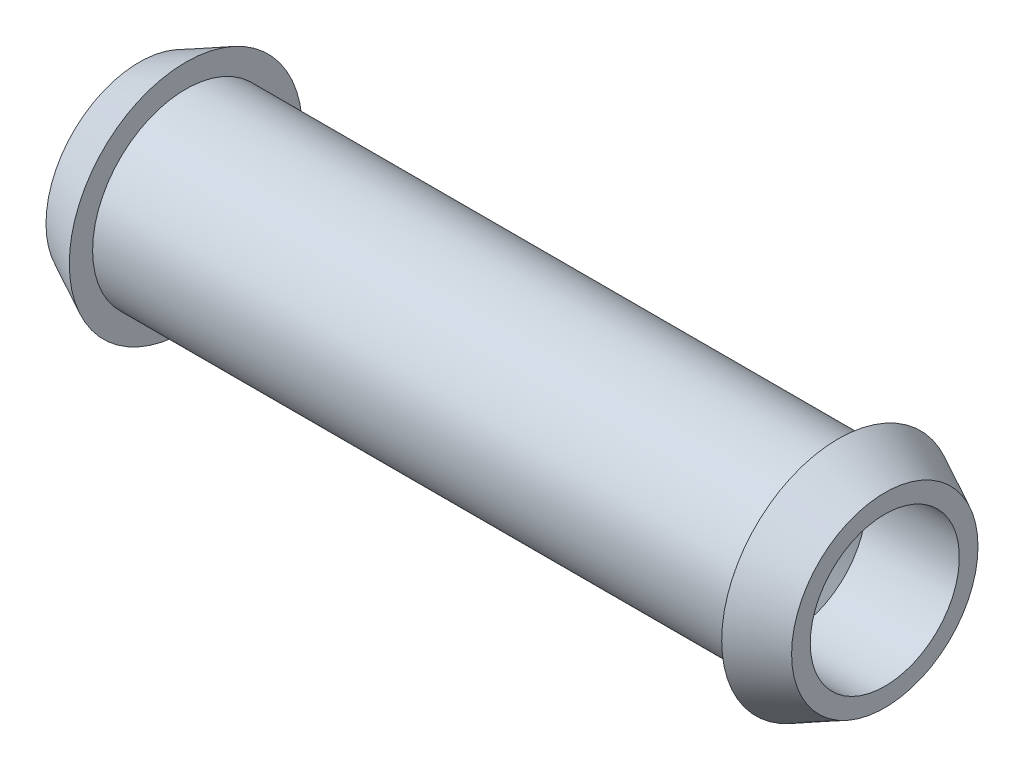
ISO-10303-21;
HEADER;
FILE_DESCRIPTION(('STEP AP214'),'2;1');
FILE_NAME('part.step','',(''),(''),'','','');
FILE_SCHEMA(('AUTOMOTIVE_DESIGN { 1 0 10303 214 1 1 1 1 }'));
ENDSEC;
DATA;
#1=APPLICATION_CONTEXT('core data for automotive mechanical design processes');
#2=APPLICATION_PROTOCOL_DEFINITION('international standard','automotive_design',2000,#1);
#3=PRODUCT_CONTEXT('',#1,'mechanical');
#4=PRODUCT('Part','Part','',(#3));
#5=PRODUCT_RELATED_PRODUCT_CATEGORY('part','',(#4));
#6=PRODUCT_DEFINITION_FORMATION('','',#4);
#7=PRODUCT_DEFINITION_CONTEXT('part definition',#1,'design');
#8=PRODUCT_DEFINITION('design','',#6,#7);
#9=PRODUCT_DEFINITION_SHAPE('','',#8);
#10=(LENGTH_UNIT() NAMED_UNIT(*) SI_UNIT(.MILLI.,.METRE.));
#11=(NAMED_UNIT(*) PLANE_ANGLE_UNIT() SI_UNIT($,.RADIAN.));
#12=(NAMED_UNIT(*) SI_UNIT($,.STERADIAN.) SOLID_ANGLE_UNIT());
#13=UNCERTAINTY_MEASURE_WITH_UNIT(LENGTH_MEASURE(1.E-05),#10,'distance_accuracy_value','');
#14=(GEOMETRIC_REPRESENTATION_CONTEXT(3) GLOBAL_UNCERTAINTY_ASSIGNED_CONTEXT((#13)) GLOBAL_UNIT_ASSIGNED_CONTEXT((#10,
#11,#12)) REPRESENTATION_CONTEXT('',''));
#15=CARTESIAN_POINT('',(0.,0.,0.));
#16=DIRECTION('',(0.,0.,1.));
#17=DIRECTION('',(1.,0.,0.));
#18=AXIS2_PLACEMENT_3D('',#15,#16,#17);
#19=CARTESIAN_POINT('',(-30.,0.,0.));
#20=DIRECTION('',(-1.,0.,0.));
#21=DIRECTION('',(0.,0.,1.));
#22=AXIS2_PLACEMENT_3D('',#19,#20,#21);
#23=CYLINDRICAL_SURFACE('',#22,5.);
#24=CARTESIAN_POINT('',(-17.5,0.,0.));
#25=DIRECTION('',(-1.,0.,0.));
#26=DIRECTION('',(0.,0.,1.));
#27=AXIS2_PLACEMENT_3D('',#24,#25,#26);
#28=CIRCLE('',#27,5.);
#29=CARTESIAN_POINT('',(-17.5,0.,5.));
#30=VERTEX_POINT('',#29);
#31=EDGE_CURVE('E11',#30,#30,#28,.T.);
#32=ORIENTED_EDGE('',*,*,#31,.F.);
#33=EDGE_LOOP('',(#32));
#34=FACE_BOUND('',#33,.T.);
#35=CARTESIAN_POINT('',(17.5,0.,0.));
#36=DIRECTION('',(1.,0.,0.));
#37=DIRECTION('',(0.,0.,-1.));
#38=AXIS2_PLACEMENT_3D('',#35,#36,#37);
#39=CIRCLE('',#38,5.);
#40=CARTESIAN_POINT('',(17.5,0.,-5.));
#41=VERTEX_POINT('',#40);
#42=EDGE_CURVE('E45',#41,#41,#39,.T.);
#43=ORIENTED_EDGE('',*,*,#42,.F.);
#44=EDGE_LOOP('',(#43));
#45=FACE_BOUND('',#44,.T.);
#46=ADVANCED_FACE('F39',(#34,#45),#23,.T.);
#47=CARTESIAN_POINT('',(-17.5,6.25,0.));
#48=DIRECTION('',(-1.,0.,0.));
#49=DIRECTION('',(0.,0.,1.));
#50=AXIS2_PLACEMENT_3D('',#47,#48,#49);
#51=PLANE('',#50);
#52=ORIENTED_EDGE('',*,*,#31,.T.);
#53=EDGE_LOOP('',(#52));
#54=FACE_BOUND('',#53,.T.);
#55=CARTESIAN_POINT('',(-17.5,0.,0.));
#56=DIRECTION('',(-1.,0.,0.));
#57=DIRECTION('',(0.,0.,1.));
#58=AXIS2_PLACEMENT_3D('',#55,#56,#57);
#59=CIRCLE('',#58,6.25);
#60=CARTESIAN_POINT('',(-17.5,0.,6.25));
#61=VERTEX_POINT('',#60);
#62=EDGE_CURVE('E81',#61,#61,#59,.T.);
#63=ORIENTED_EDGE('',*,*,#62,.F.);
#64=EDGE_LOOP('',(#63));
#65=FACE_BOUND('',#64,.T.);
#66=ADVANCED_FACE('F94',(#54,#65),#51,.F.);
#67=CARTESIAN_POINT('',(-17.5,0.,0.));
#68=DIRECTION('',(1.,0.,0.));
#69=DIRECTION('',(0.,0.,-1.));
#70=AXIS2_PLACEMENT_3D('',#67,#68,#69);
#71=CONICAL_SURFACE('',#70,6.25,0.463647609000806);
#72=CARTESIAN_POINT('',(-20.,0.,0.));
#73=DIRECTION('',(-1.,0.,0.));
#74=DIRECTION('',(0.,0.,1.));
#75=AXIS2_PLACEMENT_3D('',#72,#73,#74);
#76=CIRCLE('',#75,5.);
#77=CARTESIAN_POINT('',(-20.,0.,5.));
#78=VERTEX_POINT('',#77);
#79=EDGE_CURVE('E76',#78,#78,#76,.T.);
#80=ORIENTED_EDGE('',*,*,#79,.F.);
#81=EDGE_LOOP('',(#80));
#82=FACE_BOUND('',#81,.T.);
#83=ORIENTED_EDGE('',*,*,#62,.T.);
#84=EDGE_LOOP('',(#83));
#85=FACE_BOUND('',#84,.T.);
#86=ADVANCED_FACE('F97',(#82,#85),#71,.T.);
#87=CARTESIAN_POINT('',(-20.,5.,0.));
#88=DIRECTION('',(1.,0.,0.));
#89=DIRECTION('',(0.,0.,-1.));
#90=AXIS2_PLACEMENT_3D('',#87,#88,#89);
#91=PLANE('',#90);
#92=CARTESIAN_POINT('',(-20.,0.,0.));
#93=DIRECTION('',(-1.,0.,0.));
#94=DIRECTION('',(0.,0.,1.));
#95=AXIS2_PLACEMENT_3D('',#92,#93,#94);
#96=CIRCLE('',#95,4.);
#97=CARTESIAN_POINT('',(-20.,0.,4.));
#98=VERTEX_POINT('',#97);
#99=EDGE_CURVE('E69',#98,#98,#96,.T.);
#100=ORIENTED_EDGE('',*,*,#99,.F.);
#101=EDGE_LOOP('',(#100));
#102=FACE_BOUND('',#101,.T.);
#103=ORIENTED_EDGE('',*,*,#79,.T.);
#104=EDGE_LOOP('',(#103));
#105=FACE_BOUND('',#104,.T.);
#106=ADVANCED_FACE('F104',(#102,#105),#91,.F.);
#107=CARTESIAN_POINT('',(20.,5.,0.));
#108=DIRECTION('',(-1.,0.,0.));
#109=DIRECTION('',(0.,0.,1.));
#110=AXIS2_PLACEMENT_3D('',#107,#108,#109);
#111=PLANE('',#110);
#112=CARTESIAN_POINT('',(20.,0.,0.));
#113=DIRECTION('',(-1.,0.,0.));
#114=DIRECTION('',(0.,0.,1.));
#115=AXIS2_PLACEMENT_3D('',#112,#113,#114);
#116=CIRCLE('',#115,4.);
#117=CARTESIAN_POINT('',(20.,0.,4.));
#118=VERTEX_POINT('',#117);
#119=EDGE_CURVE('E61',#118,#118,#116,.T.);
#120=ORIENTED_EDGE('',*,*,#119,.T.);
#121=EDGE_LOOP('',(#120));
#122=FACE_BOUND('',#121,.T.);
#123=CARTESIAN_POINT('',(20.,0.,0.));
#124=DIRECTION('',(-1.,0.,0.));
#125=DIRECTION('',(0.,0.,1.));
#126=AXIS2_PLACEMENT_3D('',#123,#124,#125);
#127=CIRCLE('',#126,5.);
#128=CARTESIAN_POINT('',(20.,0.,5.));
#129=VERTEX_POINT('',#128);
#130=EDGE_CURVE('E74',#129,#129,#127,.T.);
#131=ORIENTED_EDGE('',*,*,#130,.F.);
#132=EDGE_LOOP('',(#131));
#133=FACE_BOUND('',#132,.T.);
#134=ADVANCED_FACE('F109',(#122,#133),#111,.F.);
#135=CARTESIAN_POINT('',(17.5,6.25,0.));
#136=DIRECTION('',(1.,0.,0.));
#137=DIRECTION('',(0.,0.,-1.));
#138=AXIS2_PLACEMENT_3D('',#135,#136,#137);
#139=PLANE('',#138);
#140=ORIENTED_EDGE('',*,*,#42,.T.);
#141=EDGE_LOOP('',(#140));
#142=FACE_BOUND('',#141,.T.);
#143=CARTESIAN_POINT('',(17.5,0.,0.));
#144=DIRECTION('',(-1.,0.,0.));
#145=DIRECTION('',(0.,0.,1.));
#146=AXIS2_PLACEMENT_3D('',#143,#144,#145);
#147=CIRCLE('',#146,6.25);
#148=CARTESIAN_POINT('',(17.5,0.,6.25));
#149=VERTEX_POINT('',#148);
#150=EDGE_CURVE('E73',#149,#149,#147,.T.);
#151=ORIENTED_EDGE('',*,*,#150,.T.);
#152=EDGE_LOOP('',(#151));
#153=FACE_BOUND('',#152,.T.);
#154=ADVANCED_FACE('F86',(#142,#153),#139,.F.);
#155=CARTESIAN_POINT('',(20.,0.,0.));
#156=DIRECTION('',(-1.,0.,0.));
#157=DIRECTION('',(0.,0.,1.));
#158=AXIS2_PLACEMENT_3D('',#155,#156,#157);
#159=CONICAL_SURFACE('',#158,5.,0.463647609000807);
#160=ORIENTED_EDGE('',*,*,#150,.F.);
#161=EDGE_LOOP('',(#160));
#162=FACE_BOUND('',#161,.T.);
#163=ORIENTED_EDGE('',*,*,#130,.T.);
#164=EDGE_LOOP('',(#163));
#165=FACE_BOUND('',#164,.T.);
#166=ADVANCED_FACE('F120',(#162,#165),#159,.T.);
#167=CARTESIAN_POINT('',(-22.,0.,0.));
#168=DIRECTION('',(-1.,0.,0.));
#169=DIRECTION('',(0.,0.,1.));
#170=AXIS2_PLACEMENT_3D('',#167,#168,#169);
#171=CYLINDRICAL_SURFACE('',#170,4.);
#172=ORIENTED_EDGE('',*,*,#99,.T.);
#173=EDGE_LOOP('',(#172));
#174=FACE_BOUND('',#173,.T.);
#175=CARTESIAN_POINT('',(-15.,0.,0.));
#176=DIRECTION('',(-1.,0.,0.));
#177=DIRECTION('',(0.,0.,1.));
#178=AXIS2_PLACEMENT_3D('',#175,#176,#177);
#179=CIRCLE('',#178,4.);
#180=CARTESIAN_POINT('',(-15.,0.,4.));
#181=VERTEX_POINT('',#180);
#182=EDGE_CURVE('E63',#181,#181,#179,.T.);
#183=ORIENTED_EDGE('',*,*,#182,.F.);
#184=EDGE_LOOP('',(#183));
#185=FACE_BOUND('',#184,.T.);
#186=ADVANCED_FACE('F119',(#174,#185),#171,.F.);
#187=CARTESIAN_POINT('',(-12.6905989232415,0.,0.));
#188=DIRECTION('',(-1.,0.,0.));
#189=DIRECTION('',(0.,0.,1.));
#190=AXIS2_PLACEMENT_3D('',#187,#188,#189);
#191=CONICAL_SURFACE('',#190,0.,1.0471975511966);
#192=ORIENTED_EDGE('',*,*,#182,.T.);
#193=EDGE_LOOP('',(#192));
#194=FACE_BOUND('',#193,.T.);
#195=CARTESIAN_POINT('',(-12.6905989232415,0.,0.));
#196=VERTEX_POINT('',#195);
#197=VERTEX_LOOP('',#196);
#198=FACE_BOUND('',#197,.T.);
#199=ADVANCED_FACE('F121',(#194,#198),#191,.F.);
#200=CARTESIAN_POINT('',(-22.,0.,0.));
#201=DIRECTION('',(-1.,0.,0.));
#202=DIRECTION('',(0.,0.,1.));
#203=AXIS2_PLACEMENT_3D('',#200,#201,#202);
#204=CYLINDRICAL_SURFACE('',#203,4.);
#205=CARTESIAN_POINT('',(15.,0.,0.));
#206=DIRECTION('',(-1.,0.,0.));
#207=DIRECTION('',(0.,0.,1.));
#208=AXIS2_PLACEMENT_3D('',#205,#206,#207);
#209=CIRCLE('',#208,4.);
#210=CARTESIAN_POINT('',(15.,0.,4.));
#211=VERTEX_POINT('',#210);
#212=EDGE_CURVE('E56',#211,#211,#209,.T.);
#213=ORIENTED_EDGE('',*,*,#212,.T.);
#214=EDGE_LOOP('',(#213));
#215=FACE_BOUND('',#214,.T.);
#216=ORIENTED_EDGE('',*,*,#119,.F.);
#217=EDGE_LOOP('',(#216));
#218=FACE_BOUND('',#217,.T.);
#219=ADVANCED_FACE('F54',(#215,#218),#204,.F.);
#220=CARTESIAN_POINT('',(15.,0.,0.));
#221=DIRECTION('',(1.,0.,0.));
#222=DIRECTION('',(0.,0.,-1.));
#223=AXIS2_PLACEMENT_3D('',#220,#221,#222);
#224=CONICAL_SURFACE('',#223,4.,1.0471975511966);
#225=CARTESIAN_POINT('',(12.6905989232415,0.,0.));
#226=VERTEX_POINT('',#225);
#227=VERTEX_LOOP('',#226);
#228=FACE_BOUND('',#227,.T.);
#229=ORIENTED_EDGE('',*,*,#212,.F.);
#230=EDGE_LOOP('',(#229));
#231=FACE_BOUND('',#230,.T.);
#232=ADVANCED_FACE('F55',(#228,#231),#224,.F.);
#233=CLOSED_SHELL('',(#46,#66,#86,#106,#134,#154,#166,#186,#199,#219,#232));
#234=MANIFOLD_SOLID_BREP('B2',#233);
#235=ADVANCED_BREP_SHAPE_REPRESENTATION('',(#18,#234),#14);
#236=SHAPE_DEFINITION_REPRESENTATION(#9,#235);
ENDSEC;
END-ISO-10303-21;
